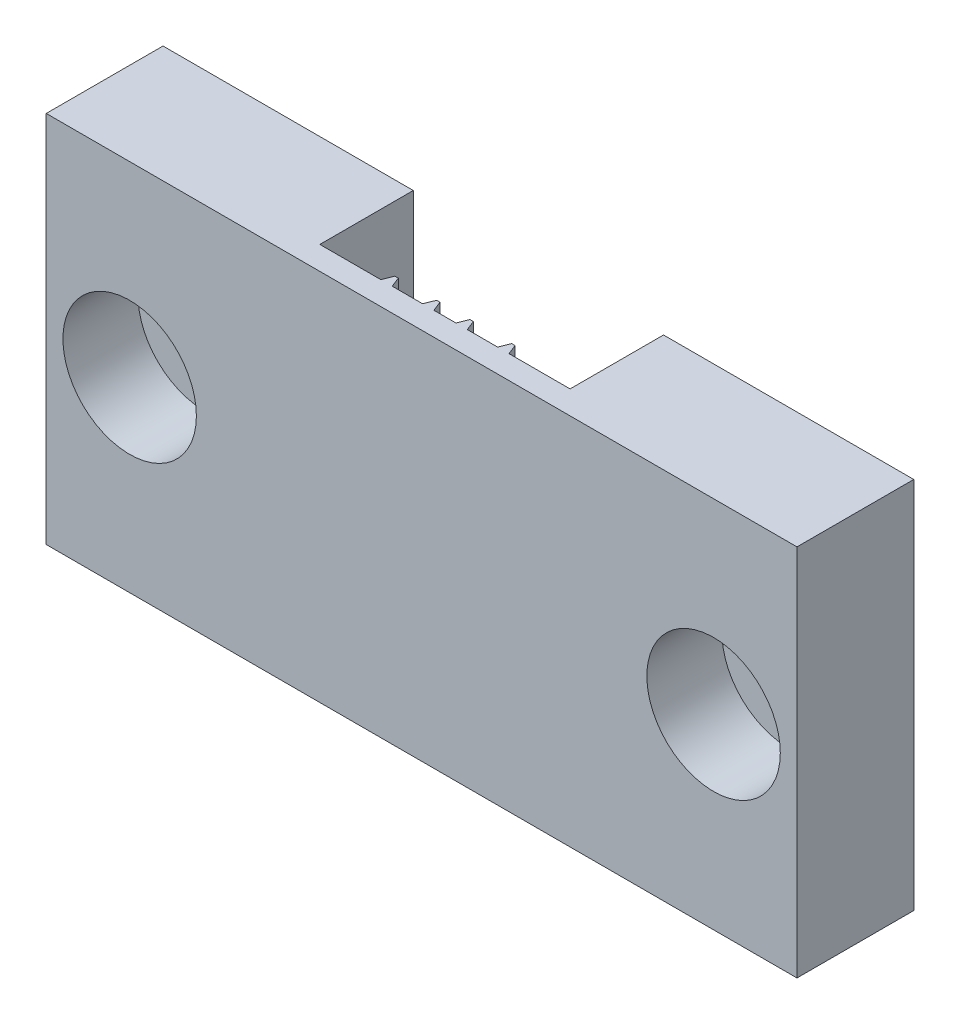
from build123d import *

# Parameters (mm, degrees)
SKETCH_1_W          = 45
SKETCH_1_H          = 22.380000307
SKETCH_1_R          = 2.25
EXTRUDE_1_DEPTH     = 7
SKETCH_2_R          = 4
CUT_EXTRUDE_1_DEPTH = 4.5
SKETCH_3_OUTSIDE_W  = 57.148
SKETCH_3_OUTSIDE_H  = 19.148
CUT_EXTRUDE_2_DEPTH = 51.743121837


with BuildPart() as part:
    # Sketch 1 → Extrude 1 (new body)
    with BuildSketch(Plane.XY):
        with Locations((22.5, 11.190000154)):
            Rectangle(SKETCH_1_W, SKETCH_1_H)
        with Locations((5, 11.180000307)):
            Circle(SKETCH_1_R, mode=Mode.SUBTRACT)
        with Locations((40, 11.180000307)):
            Circle(SKETCH_1_R, mode=Mode.SUBTRACT)
    extrude(amount=EXTRUDE_1_DEPTH)

    # Sketch 2 → Cut-Extrude 1 (cut)
    with BuildSketch(Plane.XY.offset(7)):
        with Locations((5, 11.180000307)):
            Circle(SKETCH_2_R)
        with Locations((40, 11.180000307)):
            Circle(SKETCH_2_R)
    extrude(amount=-CUT_EXTRUDE_1_DEPTH, mode=Mode.SUBTRACT)

    # Sketch 3 outside → Cut-Extrude 2 (cut, through all)
    with BuildSketch(Plane(origin=(0, 22.380000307, 0), x_dir=(1, 0, 0), z_dir=(0, 1, 0))):
        with Locations((22.5, -3.5)):
            Rectangle(SKETCH_3_OUTSIDE_W, SKETCH_3_OUTSIDE_H)
        Polygon((0, -7), (45, -7), (45, 0), (30, 0), (30, -5.6), (26.340000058, -5.6), (26.099999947, -5), (25.9, -5), (25.659999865, -5.6), (23.840000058, -5.6), (23.599999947, -5), (23.4, -5), (23.159999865, -5.6), (21.840000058, -5.6), (21.599999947, -5), (21.4, -5), (21.159999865, -5.6), (19.340000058, -5.6), (19.099999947, -5), (18.9, -5), (18.659999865, -5.6), (15, -5.6), (15, 0), (0, 0), align=None, mode=Mode.SUBTRACT)
    extrude(amount=-CUT_EXTRUDE_2_DEPTH, mode=Mode.SUBTRACT)


solid = part.part
